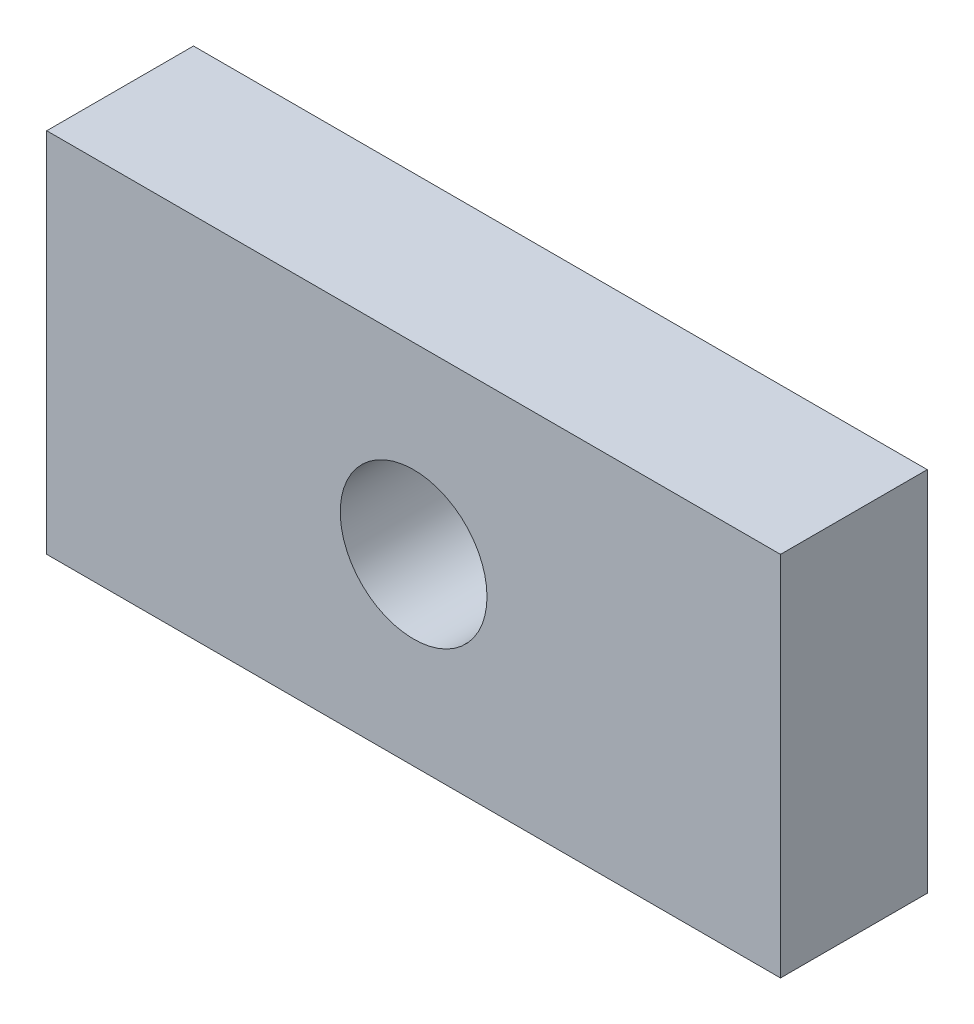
from build123d import *

# Parameters (mm, degrees)
SKETCH_1_W          = 100
SKETCH_1_H          = 50
EXTRUDE_1_DEPTH     = 20
SKETCH_2_R          = 10
CUT_EXTRUDE_1_DEPTH = 20


with BuildPart() as part:
    # Sketch 1 → Extrude 1 (new body)
    with BuildSketch(Plane.XY):
        Rectangle(SKETCH_1_W, SKETCH_1_H)
    extrude(amount=-EXTRUDE_1_DEPTH)

    # Sketch 2 → Cut-Extrude 1 (cut)
    with BuildSketch(Plane.XY):
        Circle(SKETCH_2_R)
    extrude(amount=-CUT_EXTRUDE_1_DEPTH, mode=Mode.SUBTRACT)


solid = part.part
